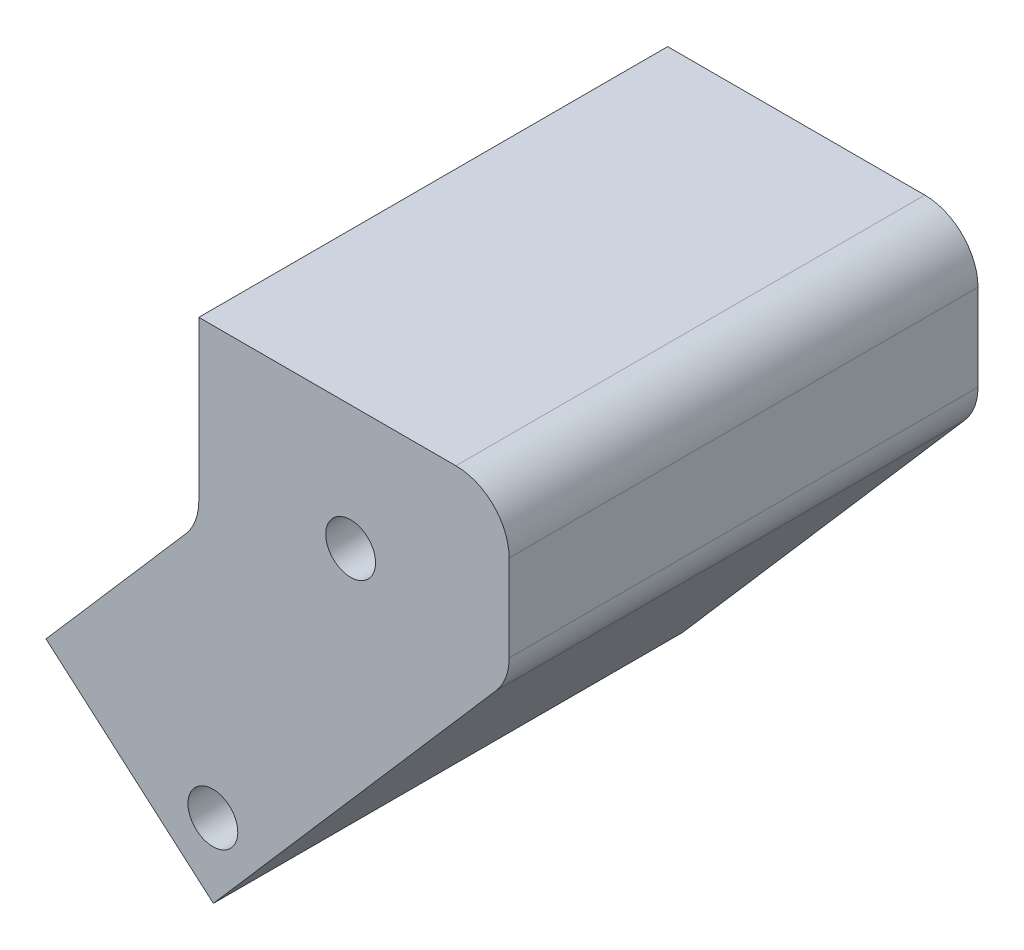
ISO-10303-21;
HEADER;
FILE_DESCRIPTION(('STEP AP214'),'2;1');
FILE_NAME('part.step','',(''),(''),'','','');
FILE_SCHEMA(('AUTOMOTIVE_DESIGN { 1 0 10303 214 1 1 1 1 }'));
ENDSEC;
DATA;
#1=APPLICATION_CONTEXT('core data for automotive mechanical design processes');
#2=APPLICATION_PROTOCOL_DEFINITION('international standard','automotive_design',2000,#1);
#3=PRODUCT_CONTEXT('',#1,'mechanical');
#4=PRODUCT('Part','Part','',(#3));
#5=PRODUCT_RELATED_PRODUCT_CATEGORY('part','',(#4));
#6=PRODUCT_DEFINITION_FORMATION('','',#4);
#7=PRODUCT_DEFINITION_CONTEXT('part definition',#1,'design');
#8=PRODUCT_DEFINITION('design','',#6,#7);
#9=PRODUCT_DEFINITION_SHAPE('','',#8);
#10=(LENGTH_UNIT() NAMED_UNIT(*) SI_UNIT(.MILLI.,.METRE.));
#11=(NAMED_UNIT(*) PLANE_ANGLE_UNIT() SI_UNIT($,.RADIAN.));
#12=(NAMED_UNIT(*) SI_UNIT($,.STERADIAN.) SOLID_ANGLE_UNIT());
#13=UNCERTAINTY_MEASURE_WITH_UNIT(LENGTH_MEASURE(1.E-05),#10,'distance_accuracy_value','');
#14=(GEOMETRIC_REPRESENTATION_CONTEXT(3) GLOBAL_UNCERTAINTY_ASSIGNED_CONTEXT((#13)) GLOBAL_UNIT_ASSIGNED_CONTEXT((#10,
#11,#12)) REPRESENTATION_CONTEXT('',''));
#15=CARTESIAN_POINT('',(0.,0.,0.));
#16=DIRECTION('',(0.,0.,1.));
#17=DIRECTION('',(1.,0.,0.));
#18=AXIS2_PLACEMENT_3D('',#15,#16,#17);
#19=CARTESIAN_POINT('',(-7.61612994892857E-11,2.4757973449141E-11,4.79986189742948));
#20=DIRECTION('',(-1.58417609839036E-11,5.13786431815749E-12,1.));
#21=DIRECTION('',(1.,0.,1.58417609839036E-11));
#22=AXIS2_PLACEMENT_3D('',#19,#20,#21);
#23=PLANE('',#22);
#24=CARTESIAN_POINT('',(-641.825795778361,-31.0085922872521,4.79986188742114));
#25=DIRECTION('',(0.,-5.13786431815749E-12,-1.));
#26=DIRECTION('',(0.,1.,-5.13786431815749E-12));
#27=AXIS2_PLACEMENT_3D('',#24,#25,#26);
#28=CIRCLE('',#27,5.35940000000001);
#29=CARTESIAN_POINT('',(-641.825795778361,-25.6491922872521,4.7998618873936));
#30=VERTEX_POINT('',#29);
#31=EDGE_CURVE('E262',#30,#30,#28,.T.);
#32=ORIENTED_EDGE('',*,*,#31,.F.);
#33=EDGE_LOOP('',(#32));
#34=FACE_BOUND('',#33,.T.);
#35=CARTESIAN_POINT('',(-661.55866411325,-74.2842172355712,4.79986188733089));
#36=DIRECTION('',(0.,-5.13786431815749E-12,-1.));
#37=DIRECTION('',(0.,1.,-5.13786431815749E-12));
#38=AXIS2_PLACEMENT_3D('',#35,#36,#37);
#39=CIRCLE('',#38,5.35940000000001);
#40=CARTESIAN_POINT('',(-661.55866411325,-68.9248172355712,4.79986188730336));
#41=VERTEX_POINT('',#40);
#42=EDGE_CURVE('E246',#41,#41,#39,.T.);
#43=ORIENTED_EDGE('',*,*,#42,.F.);
#44=EDGE_LOOP('',(#43));
#45=FACE_BOUND('',#44,.T.);
#46=DIRECTION('',(0.755030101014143,-0.655690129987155,1.53298533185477E-11));
#47=VECTOR('',#46,1.);
#48=CARTESIAN_POINT('',(-661.489319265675,-84.8572642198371,4.79986188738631));
#49=LINE('',#48,#47);
#50=CARTESIAN_POINT('',(-685.461524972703,-64.0391025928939,4.79986188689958));
#51=VERTEX_POINT('',#50);
#52=CARTESIAN_POINT('',(-661.489319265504,-84.8572642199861,4.79986188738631));
#53=VERTEX_POINT('',#52);
#54=EDGE_CURVE('E118',#51,#53,#49,.T.);
#55=ORIENTED_EDGE('',*,*,#54,.F.);
#56=DIRECTION('',(-0.655690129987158,-0.755030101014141,-6.50804410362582E-12));
#57=VECTOR('',#56,1.);
#58=CARTESIAN_POINT('',(-685.461524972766,-64.0391025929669,4.79986188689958));
#59=LINE('',#58,#57);
#60=CARTESIAN_POINT('',(-665.441670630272,-40.9861512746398,4.79986188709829));
#61=VERTEX_POINT('',#60);
#62=EDGE_CURVE('E125',#61,#51,#59,.T.);
#63=ORIENTED_EDGE('',*,*,#62,.F.);
#64=CARTESIAN_POINT('',(-671.195,-35.9897924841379,4.79986188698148));
#65=DIRECTION('',(-1.58417609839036E-11,5.13786431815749E-12,1.));
#66=DIRECTION('',(1.,0.,1.58417609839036E-11));
#67=AXIS2_PLACEMENT_3D('',#64,#65,#66);
#68=CIRCLE('',#67,7.61999999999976);
#69=CARTESIAN_POINT('',(-663.575,-35.9897924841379,4.7998618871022));
#70=VERTEX_POINT('',#69);
#71=EDGE_CURVE('E229',#70,#61,#68,.F.);
#72=ORIENTED_EDGE('',*,*,#71,.F.);
#73=DIRECTION('',(0.,-1.,5.13786431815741E-12));
#74=VECTOR('',#73,1.);
#75=CARTESIAN_POINT('',(-663.575,-35.9897924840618,4.7998618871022));
#76=LINE('',#75,#74);
#77=CARTESIAN_POINT('',(-663.575,-13.1998728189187,4.7998618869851));
#78=VERTEX_POINT('',#77);
#79=EDGE_CURVE('E225',#78,#70,#76,.T.);
#80=ORIENTED_EDGE('',*,*,#79,.F.);
#81=DIRECTION('',(-1.,0.,-1.58417609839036E-11));
#82=VECTOR('',#81,1.);
#83=CARTESIAN_POINT('',(-663.575000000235,-13.1998728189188,4.7998618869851));
#84=LINE('',#83,#82);
#85=CARTESIAN_POINT('',(-626.745,-13.1998728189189,4.79986188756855));
#86=VERTEX_POINT('',#85);
#87=EDGE_CURVE('E235',#86,#78,#84,.T.);
#88=ORIENTED_EDGE('',*,*,#87,.F.);
#89=CARTESIAN_POINT('',(-626.745,-20.8198728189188,4.7998618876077));
#90=DIRECTION('',(-1.58417609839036E-11,5.13786431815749E-12,1.));
#91=DIRECTION('',(1.,0.,1.58417609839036E-11));
#92=AXIS2_PLACEMENT_3D('',#89,#90,#91);
#93=CIRCLE('',#92,7.61999999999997);
#94=CARTESIAN_POINT('',(-619.125,-20.8198728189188,4.79986188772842));
#95=VERTEX_POINT('',#94);
#96=EDGE_CURVE('E216',#95,#86,#93,.T.);
#97=ORIENTED_EDGE('',*,*,#96,.F.);
#98=DIRECTION('',(0.,1.,-5.13786431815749E-12));
#99=VECTOR('',#98,1.);
#100=CARTESIAN_POINT('',(-619.125,-20.8198728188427,4.79986188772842));
#101=LINE('',#100,#99);
#102=CARTESIAN_POINT('',(-619.125,-33.2276829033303,4.79986188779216));
#103=VERTEX_POINT('',#102);
#104=EDGE_CURVE('E211',#103,#95,#101,.T.);
#105=ORIENTED_EDGE('',*,*,#104,.F.);
#106=CARTESIAN_POINT('',(-626.745,-33.2276829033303,4.79986188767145));
#107=DIRECTION('',(-1.58417609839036E-11,5.13786431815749E-12,1.));
#108=DIRECTION('',(1.,0.,1.58417609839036E-11));
#109=AXIS2_PLACEMENT_3D('',#106,#107,#108);
#110=CIRCLE('',#109,7.61999999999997);
#111=CARTESIAN_POINT('',(-620.991670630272,-38.2240416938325,4.79986188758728));
#112=VERTEX_POINT('',#111);
#113=EDGE_CURVE('E64',#112,#103,#110,.T.);
#114=ORIENTED_EDGE('',*,*,#113,.F.);
#115=DIRECTION('',(0.65569012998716,0.755030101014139,6.50804410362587E-12));
#116=VECTOR('',#115,1.);
#117=CARTESIAN_POINT('',(-620.991670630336,-38.2240416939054,4.79986188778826));
#118=LINE('',#117,#116);
#119=EDGE_CURVE('E12',#53,#112,#118,.T.);
#120=ORIENTED_EDGE('',*,*,#119,.F.);
#121=EDGE_LOOP('',(#55,#63,#72,#80,#88,#97,#105,#114,#120));
#122=FACE_BOUND('',#121,.T.);
#123=ADVANCED_FACE('F48',(#34,#45,#122),#23,.F.);
#124=CARTESIAN_POINT('',(-661.489319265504,-84.8572642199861,-10.033));
#125=DIRECTION('',(0.655690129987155,0.755030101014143,0.));
#126=DIRECTION('',(-0.755030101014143,0.655690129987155,0.));
#127=AXIS2_PLACEMENT_3D('',#124,#125,#126);
#128=PLANE('',#127);
#129=DIRECTION('',(0.,0.,1.));
#130=VECTOR('',#129,1.);
#131=CARTESIAN_POINT('',(-685.461524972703,-64.0391025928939,-10.033));
#132=LINE('',#131,#130);
#133=CARTESIAN_POINT('',(-685.461524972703,-64.0391025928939,71.9582));
#134=VERTEX_POINT('',#133);
#135=EDGE_CURVE('E57',#51,#134,#132,.T.);
#136=ORIENTED_EDGE('',*,*,#135,.F.);
#137=ORIENTED_EDGE('',*,*,#54,.T.);
#138=DIRECTION('',(0.,0.,1.));
#139=VECTOR('',#138,1.);
#140=CARTESIAN_POINT('',(-661.489319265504,-84.8572642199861,-10.033));
#141=LINE('',#140,#139);
#142=CARTESIAN_POINT('',(-661.489319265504,-84.8572642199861,71.9582));
#143=VERTEX_POINT('',#142);
#144=EDGE_CURVE('E71',#53,#143,#141,.T.);
#145=ORIENTED_EDGE('',*,*,#144,.T.);
#146=DIRECTION('',(-0.755030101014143,0.655690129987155,0.));
#147=VECTOR('',#146,1.);
#148=CARTESIAN_POINT('',(-661.489319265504,-84.8572642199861,71.9582));
#149=LINE('',#148,#147);
#150=EDGE_CURVE('E124',#143,#134,#149,.T.);
#151=ORIENTED_EDGE('',*,*,#150,.T.);
#152=EDGE_LOOP('',(#136,#137,#145,#151));
#153=FACE_BOUND('',#152,.T.);
#154=ADVANCED_FACE('F50',(#153),#128,.F.);
#155=CARTESIAN_POINT('',(-685.461524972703,-64.0391025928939,-10.033));
#156=DIRECTION('',(0.755030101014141,-0.655690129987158,0.));
#157=DIRECTION('',(0.655690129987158,0.755030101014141,0.));
#158=AXIS2_PLACEMENT_3D('',#155,#156,#157);
#159=PLANE('',#158);
#160=DIRECTION('',(0.,0.,1.));
#161=VECTOR('',#160,1.);
#162=CARTESIAN_POINT('',(-665.441670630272,-40.9861512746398,-10.033));
#163=LINE('',#162,#161);
#164=CARTESIAN_POINT('',(-665.441670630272,-40.9861512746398,71.9582));
#165=VERTEX_POINT('',#164);
#166=EDGE_CURVE('E157',#61,#165,#163,.T.);
#167=ORIENTED_EDGE('',*,*,#166,.F.);
#168=ORIENTED_EDGE('',*,*,#62,.T.);
#169=ORIENTED_EDGE('',*,*,#135,.T.);
#170=DIRECTION('',(0.655690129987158,0.755030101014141,0.));
#171=VECTOR('',#170,1.);
#172=CARTESIAN_POINT('',(-685.461524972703,-64.0391025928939,71.9582));
#173=LINE('',#172,#171);
#174=EDGE_CURVE('E166',#134,#165,#173,.T.);
#175=ORIENTED_EDGE('',*,*,#174,.T.);
#176=EDGE_LOOP('',(#167,#168,#169,#175));
#177=FACE_BOUND('',#176,.T.);
#178=ADVANCED_FACE('F165',(#177),#159,.F.);
#179=CARTESIAN_POINT('',(-671.195,-35.9897924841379,-10.033));
#180=DIRECTION('',(0.,0.,1.));
#181=DIRECTION('',(1.,0.,0.));
#182=AXIS2_PLACEMENT_3D('',#179,#180,#181);
#183=CYLINDRICAL_SURFACE('',#182,7.61999999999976);
#184=DIRECTION('',(0.,0.,1.));
#185=VECTOR('',#184,1.);
#186=CARTESIAN_POINT('',(-663.575,-35.9897924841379,-10.033));
#187=LINE('',#186,#185);
#188=CARTESIAN_POINT('',(-663.575,-35.9897924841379,71.9582));
#189=VERTEX_POINT('',#188);
#190=EDGE_CURVE('E154',#70,#189,#187,.T.);
#191=ORIENTED_EDGE('',*,*,#190,.F.);
#192=ORIENTED_EDGE('',*,*,#71,.T.);
#193=ORIENTED_EDGE('',*,*,#166,.T.);
#194=CARTESIAN_POINT('',(-671.195,-35.9897924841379,71.9582));
#195=DIRECTION('',(0.,0.,1.));
#196=DIRECTION('',(-1.,0.,0.));
#197=AXIS2_PLACEMENT_3D('',#194,#195,#196);
#198=CIRCLE('',#197,7.61999999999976);
#199=EDGE_CURVE('E172',#165,#189,#198,.T.);
#200=ORIENTED_EDGE('',*,*,#199,.T.);
#201=EDGE_LOOP('',(#191,#192,#193,#200));
#202=FACE_BOUND('',#201,.T.);
#203=ADVANCED_FACE('F228',(#202),#183,.F.);
#204=CARTESIAN_POINT('',(-663.575,-35.9897924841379,-10.033));
#205=DIRECTION('',(1.,0.,0.));
#206=DIRECTION('',(0.,1.,0.));
#207=AXIS2_PLACEMENT_3D('',#204,#205,#206);
#208=PLANE('',#207);
#209=DIRECTION('',(0.,0.,1.));
#210=VECTOR('',#209,1.);
#211=CARTESIAN_POINT('',(-663.575,-13.1998728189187,-10.033));
#212=LINE('',#211,#210);
#213=CARTESIAN_POINT('',(-663.575,-13.1998728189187,71.9582));
#214=VERTEX_POINT('',#213);
#215=EDGE_CURVE('E151',#78,#214,#212,.T.);
#216=ORIENTED_EDGE('',*,*,#215,.F.);
#217=ORIENTED_EDGE('',*,*,#79,.T.);
#218=ORIENTED_EDGE('',*,*,#190,.T.);
#219=DIRECTION('',(0.,1.,0.));
#220=VECTOR('',#219,1.);
#221=CARTESIAN_POINT('',(-663.575,-35.9897924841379,71.9582));
#222=LINE('',#221,#220);
#223=EDGE_CURVE('E182',#189,#214,#222,.T.);
#224=ORIENTED_EDGE('',*,*,#223,.T.);
#225=EDGE_LOOP('',(#216,#217,#218,#224));
#226=FACE_BOUND('',#225,.T.);
#227=ADVANCED_FACE('F222',(#226),#208,.F.);
#228=CARTESIAN_POINT('',(-663.575,-13.1998728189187,-10.033));
#229=DIRECTION('',(0.,-1.,0.));
#230=DIRECTION('',(1.,0.,0.));
#231=AXIS2_PLACEMENT_3D('',#228,#229,#230);
#232=PLANE('',#231);
#233=DIRECTION('',(0.,0.,1.));
#234=VECTOR('',#233,1.);
#235=CARTESIAN_POINT('',(-626.745,-13.1998728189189,-10.033));
#236=LINE('',#235,#234);
#237=CARTESIAN_POINT('',(-626.745,-13.1998728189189,71.9582));
#238=VERTEX_POINT('',#237);
#239=EDGE_CURVE('E148',#86,#238,#236,.T.);
#240=ORIENTED_EDGE('',*,*,#239,.F.);
#241=ORIENTED_EDGE('',*,*,#87,.T.);
#242=ORIENTED_EDGE('',*,*,#215,.T.);
#243=DIRECTION('',(1.,0.,0.));
#244=VECTOR('',#243,1.);
#245=CARTESIAN_POINT('',(-663.575,-13.1998728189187,71.9582));
#246=LINE('',#245,#244);
#247=EDGE_CURVE('E186',#214,#238,#246,.T.);
#248=ORIENTED_EDGE('',*,*,#247,.T.);
#249=EDGE_LOOP('',(#240,#241,#242,#248));
#250=FACE_BOUND('',#249,.T.);
#251=ADVANCED_FACE('F219',(#250),#232,.F.);
#252=CARTESIAN_POINT('',(-626.745,-20.8198728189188,-10.033));
#253=DIRECTION('',(0.,0.,1.));
#254=DIRECTION('',(1.,0.,0.));
#255=AXIS2_PLACEMENT_3D('',#252,#253,#254);
#256=CYLINDRICAL_SURFACE('',#255,7.61999999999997);
#257=DIRECTION('',(0.,0.,1.));
#258=VECTOR('',#257,1.);
#259=CARTESIAN_POINT('',(-619.125,-20.8198728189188,-10.033));
#260=LINE('',#259,#258);
#261=CARTESIAN_POINT('',(-619.125,-20.8198728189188,71.9582));
#262=VERTEX_POINT('',#261);
#263=EDGE_CURVE('E145',#95,#262,#260,.T.);
#264=ORIENTED_EDGE('',*,*,#263,.F.);
#265=ORIENTED_EDGE('',*,*,#96,.T.);
#266=ORIENTED_EDGE('',*,*,#239,.T.);
#267=CARTESIAN_POINT('',(-626.745,-20.8198728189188,71.9582));
#268=DIRECTION('',(0.,0.,-1.));
#269=DIRECTION('',(-1.,0.,0.));
#270=AXIS2_PLACEMENT_3D('',#267,#268,#269);
#271=CIRCLE('',#270,7.61999999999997);
#272=EDGE_CURVE('E190',#238,#262,#271,.T.);
#273=ORIENTED_EDGE('',*,*,#272,.T.);
#274=EDGE_LOOP('',(#264,#265,#266,#273));
#275=FACE_BOUND('',#274,.T.);
#276=ADVANCED_FACE('F214',(#275),#256,.T.);
#277=CARTESIAN_POINT('',(-619.125,-20.8198728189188,-10.033));
#278=DIRECTION('',(-1.,0.,0.));
#279=DIRECTION('',(0.,0.,1.));
#280=AXIS2_PLACEMENT_3D('',#277,#278,#279);
#281=PLANE('',#280);
#282=DIRECTION('',(0.,0.,1.));
#283=VECTOR('',#282,1.);
#284=CARTESIAN_POINT('',(-619.125,-33.2276829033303,-10.033));
#285=LINE('',#284,#283);
#286=CARTESIAN_POINT('',(-619.125,-33.2276829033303,71.9582));
#287=VERTEX_POINT('',#286);
#288=EDGE_CURVE('E137',#103,#287,#285,.T.);
#289=ORIENTED_EDGE('',*,*,#288,.F.);
#290=ORIENTED_EDGE('',*,*,#104,.T.);
#291=ORIENTED_EDGE('',*,*,#263,.T.);
#292=DIRECTION('',(0.,-1.,0.));
#293=VECTOR('',#292,1.);
#294=CARTESIAN_POINT('',(-619.125,-20.8198728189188,71.9582));
#295=LINE('',#294,#293);
#296=EDGE_CURVE('E194',#262,#287,#295,.T.);
#297=ORIENTED_EDGE('',*,*,#296,.T.);
#298=EDGE_LOOP('',(#289,#290,#291,#297));
#299=FACE_BOUND('',#298,.T.);
#300=ADVANCED_FACE('F208',(#299),#281,.F.);
#301=CARTESIAN_POINT('',(-626.745,-33.2276829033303,-10.033));
#302=DIRECTION('',(0.,0.,1.));
#303=DIRECTION('',(1.,0.,0.));
#304=AXIS2_PLACEMENT_3D('',#301,#302,#303);
#305=CYLINDRICAL_SURFACE('',#304,7.61999999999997);
#306=DIRECTION('',(0.,0.,1.));
#307=VECTOR('',#306,1.);
#308=CARTESIAN_POINT('',(-620.991670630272,-38.2240416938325,-10.033));
#309=LINE('',#308,#307);
#310=CARTESIAN_POINT('',(-620.991670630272,-38.2240416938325,71.9582));
#311=VERTEX_POINT('',#310);
#312=EDGE_CURVE('E132',#112,#311,#309,.T.);
#313=ORIENTED_EDGE('',*,*,#312,.F.);
#314=ORIENTED_EDGE('',*,*,#113,.T.);
#315=ORIENTED_EDGE('',*,*,#288,.T.);
#316=CARTESIAN_POINT('',(-626.745,-33.2276829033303,71.9582));
#317=DIRECTION('',(0.,0.,-1.));
#318=DIRECTION('',(-1.,0.,0.));
#319=AXIS2_PLACEMENT_3D('',#316,#317,#318);
#320=CIRCLE('',#319,7.61999999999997);
#321=EDGE_CURVE('E139',#287,#311,#320,.T.);
#322=ORIENTED_EDGE('',*,*,#321,.T.);
#323=EDGE_LOOP('',(#313,#314,#315,#322));
#324=FACE_BOUND('',#323,.T.);
#325=ADVANCED_FACE('F202',(#324),#305,.T.);
#326=CARTESIAN_POINT('',(-620.991670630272,-38.2240416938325,-10.033));
#327=DIRECTION('',(-0.755030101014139,0.65569012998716,0.));
#328=DIRECTION('',(-0.65569012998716,-0.755030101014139,0.));
#329=AXIS2_PLACEMENT_3D('',#326,#327,#328);
#330=PLANE('',#329);
#331=ORIENTED_EDGE('',*,*,#144,.F.);
#332=ORIENTED_EDGE('',*,*,#119,.T.);
#333=ORIENTED_EDGE('',*,*,#312,.T.);
#334=DIRECTION('',(-0.65569012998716,-0.755030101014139,0.));
#335=VECTOR('',#334,1.);
#336=CARTESIAN_POINT('',(-620.991670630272,-38.2240416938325,71.9582));
#337=LINE('',#336,#335);
#338=EDGE_CURVE('E129',#311,#143,#337,.T.);
#339=ORIENTED_EDGE('',*,*,#338,.T.);
#340=EDGE_LOOP('',(#331,#332,#333,#339));
#341=FACE_BOUND('',#340,.T.);
#342=ADVANCED_FACE('F127',(#341),#330,.F.);
#343=CARTESIAN_POINT('',(-671.195,-35.9897924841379,71.9582));
#344=DIRECTION('',(0.,0.,-1.));
#345=DIRECTION('',(-1.,0.,0.));
#346=AXIS2_PLACEMENT_3D('',#343,#344,#345);
#347=PLANE('',#346);
#348=CARTESIAN_POINT('',(-641.825795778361,-31.0085922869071,71.9582000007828));
#349=DIRECTION('',(0.,-5.13786431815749E-12,-1.));
#350=DIRECTION('',(0.,1.,-5.13786431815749E-12));
#351=AXIS2_PLACEMENT_3D('',#348,#349,#350);
#352=CIRCLE('',#351,3.56869999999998);
#353=CARTESIAN_POINT('',(-641.825795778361,-27.4398922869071,71.9582000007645));
#354=VERTEX_POINT('',#353);
#355=EDGE_CURVE('E274',#354,#354,#352,.T.);
#356=ORIENTED_EDGE('',*,*,#355,.T.);
#357=EDGE_LOOP('',(#356));
#358=FACE_BOUND('',#357,.T.);
#359=CARTESIAN_POINT('',(-661.558664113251,-74.2842172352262,71.9582000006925));
#360=DIRECTION('',(0.,-5.13786431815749E-12,-1.));
#361=DIRECTION('',(0.,1.,-5.13786431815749E-12));
#362=AXIS2_PLACEMENT_3D('',#359,#360,#361);
#363=CIRCLE('',#362,3.56869999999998);
#364=CARTESIAN_POINT('',(-661.558664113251,-70.7155172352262,71.9582000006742));
#365=VERTEX_POINT('',#364);
#366=EDGE_CURVE('E258',#365,#365,#363,.T.);
#367=ORIENTED_EDGE('',*,*,#366,.T.);
#368=EDGE_LOOP('',(#367));
#369=FACE_BOUND('',#368,.T.);
#370=ORIENTED_EDGE('',*,*,#150,.F.);
#371=ORIENTED_EDGE('',*,*,#338,.F.);
#372=ORIENTED_EDGE('',*,*,#321,.F.);
#373=ORIENTED_EDGE('',*,*,#296,.F.);
#374=ORIENTED_EDGE('',*,*,#272,.F.);
#375=ORIENTED_EDGE('',*,*,#247,.F.);
#376=ORIENTED_EDGE('',*,*,#223,.F.);
#377=ORIENTED_EDGE('',*,*,#199,.F.);
#378=ORIENTED_EDGE('',*,*,#174,.F.);
#379=EDGE_LOOP('',(#370,#371,#372,#373,#374,#375,#376,#377,#378));
#380=FACE_BOUND('',#379,.T.);
#381=ADVANCED_FACE('F169',(#358,#369,#380),#347,.F.);
#382=CARTESIAN_POINT('',(-661.55866411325,-74.2842172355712,4.79986188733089));
#383=DIRECTION('',(0.,-5.13786431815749E-12,-1.));
#384=DIRECTION('',(0.,1.,-5.13786431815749E-12));
#385=AXIS2_PLACEMENT_3D('',#382,#383,#384);
#386=CYLINDRICAL_SURFACE('',#385,5.35940000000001);
#387=CARTESIAN_POINT('',(-661.55866411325,-74.284217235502,18.2618618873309));
#388=DIRECTION('',(0.,-5.13786431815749E-12,-1.));
#389=DIRECTION('',(0.,1.,-5.13786431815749E-12));
#390=AXIS2_PLACEMENT_3D('',#387,#388,#389);
#391=CIRCLE('',#390,5.35940000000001);
#392=CARTESIAN_POINT('',(-661.55866411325,-68.924817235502,18.2618618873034));
#393=VERTEX_POINT('',#392);
#394=EDGE_CURVE('E250',#393,#393,#391,.T.);
#395=ORIENTED_EDGE('',*,*,#394,.F.);
#396=EDGE_LOOP('',(#395));
#397=FACE_BOUND('',#396,.T.);
#398=ORIENTED_EDGE('',*,*,#42,.T.);
#399=EDGE_LOOP('',(#398));
#400=FACE_BOUND('',#399,.T.);
#401=ADVANCED_FACE('F306',(#397,#400),#386,.F.);
#402=CARTESIAN_POINT('',(-657.98996411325,-74.2842172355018,18.2618618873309));
#403=DIRECTION('',(0.,5.13786431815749E-12,1.));
#404=DIRECTION('',(0.,-1.,5.13786431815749E-12));
#405=AXIS2_PLACEMENT_3D('',#402,#403,#404);
#406=PLANE('',#405);
#407=CARTESIAN_POINT('',(-661.55866411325,-74.284217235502,18.2618618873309));
#408=DIRECTION('',(0.,-5.13786431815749E-12,-1.));
#409=DIRECTION('',(0.,1.,-5.13786431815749E-12));
#410=AXIS2_PLACEMENT_3D('',#407,#408,#409);
#411=CIRCLE('',#410,3.56869999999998);
#412=CARTESIAN_POINT('',(-661.55866411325,-70.715517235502,18.2618618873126));
#413=VERTEX_POINT('',#412);
#414=EDGE_CURVE('E254',#413,#413,#411,.T.);
#415=ORIENTED_EDGE('',*,*,#414,.F.);
#416=EDGE_LOOP('',(#415));
#417=FACE_BOUND('',#416,.T.);
#418=ORIENTED_EDGE('',*,*,#394,.T.);
#419=EDGE_LOOP('',(#418));
#420=FACE_BOUND('',#419,.T.);
#421=ADVANCED_FACE('F308',(#417,#420),#406,.F.);
#422=CARTESIAN_POINT('',(-661.55866411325,-74.2842172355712,4.79986188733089));
#423=DIRECTION('',(0.,-5.13786431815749E-12,-1.));
#424=DIRECTION('',(0.,1.,-5.13786431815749E-12));
#425=AXIS2_PLACEMENT_3D('',#422,#423,#424);
#426=CYLINDRICAL_SURFACE('',#425,3.56869999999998);
#427=ORIENTED_EDGE('',*,*,#366,.F.);
#428=EDGE_LOOP('',(#427));
#429=FACE_BOUND('',#428,.T.);
#430=ORIENTED_EDGE('',*,*,#414,.T.);
#431=EDGE_LOOP('',(#430));
#432=FACE_BOUND('',#431,.T.);
#433=ADVANCED_FACE('F297',(#429,#432),#426,.F.);
#434=CARTESIAN_POINT('',(-641.825795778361,-31.0085922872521,4.79986188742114));
#435=DIRECTION('',(0.,-5.13786431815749E-12,-1.));
#436=DIRECTION('',(0.,1.,-5.13786431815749E-12));
#437=AXIS2_PLACEMENT_3D('',#434,#435,#436);
#438=CYLINDRICAL_SURFACE('',#437,5.35940000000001);
#439=CARTESIAN_POINT('',(-641.825795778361,-31.0085922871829,18.2618618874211));
#440=DIRECTION('',(0.,-5.13786431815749E-12,-1.));
#441=DIRECTION('',(0.,1.,-5.13786431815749E-12));
#442=AXIS2_PLACEMENT_3D('',#439,#440,#441);
#443=CIRCLE('',#442,5.35940000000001);
#444=CARTESIAN_POINT('',(-641.825795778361,-25.6491922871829,18.2618618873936));
#445=VERTEX_POINT('',#444);
#446=EDGE_CURVE('E266',#445,#445,#443,.T.);
#447=ORIENTED_EDGE('',*,*,#446,.F.);
#448=EDGE_LOOP('',(#447));
#449=FACE_BOUND('',#448,.T.);
#450=ORIENTED_EDGE('',*,*,#31,.T.);
#451=EDGE_LOOP('',(#450));
#452=FACE_BOUND('',#451,.T.);
#453=ADVANCED_FACE('F291',(#449,#452),#438,.F.);
#454=CARTESIAN_POINT('',(-638.257095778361,-31.0085922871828,18.2618618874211));
#455=DIRECTION('',(0.,5.13786431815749E-12,1.));
#456=DIRECTION('',(0.,-1.,5.13786431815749E-12));
#457=AXIS2_PLACEMENT_3D('',#454,#455,#456);
#458=PLANE('',#457);
#459=CARTESIAN_POINT('',(-641.825795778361,-31.0085922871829,18.2618618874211));
#460=DIRECTION('',(0.,-5.13786431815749E-12,-1.));
#461=DIRECTION('',(0.,1.,-5.13786431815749E-12));
#462=AXIS2_PLACEMENT_3D('',#459,#460,#461);
#463=CIRCLE('',#462,3.56869999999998);
#464=CARTESIAN_POINT('',(-641.825795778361,-27.439892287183,18.2618618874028));
#465=VERTEX_POINT('',#464);
#466=EDGE_CURVE('E270',#465,#465,#463,.T.);
#467=ORIENTED_EDGE('',*,*,#466,.F.);
#468=EDGE_LOOP('',(#467));
#469=FACE_BOUND('',#468,.T.);
#470=ORIENTED_EDGE('',*,*,#446,.T.);
#471=EDGE_LOOP('',(#470));
#472=FACE_BOUND('',#471,.T.);
#473=ADVANCED_FACE('F285',(#469,#472),#458,.F.);
#474=CARTESIAN_POINT('',(-641.825795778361,-31.0085922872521,4.79986188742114));
#475=DIRECTION('',(0.,-5.13786431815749E-12,-1.));
#476=DIRECTION('',(0.,1.,-5.13786431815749E-12));
#477=AXIS2_PLACEMENT_3D('',#474,#475,#476);
#478=CYLINDRICAL_SURFACE('',#477,3.56869999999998);
#479=ORIENTED_EDGE('',*,*,#355,.F.);
#480=EDGE_LOOP('',(#479));
#481=FACE_BOUND('',#480,.T.);
#482=ORIENTED_EDGE('',*,*,#466,.T.);
#483=EDGE_LOOP('',(#482));
#484=FACE_BOUND('',#483,.T.);
#485=ADVANCED_FACE('F282',(#481,#484),#478,.F.);
#486=CLOSED_SHELL('',(#123,#154,#178,#203,#227,#251,#276,#300,#325,#342,#381,#401,#421,#433,
#453,#473,#485));
#487=MANIFOLD_SOLID_BREP('B2',#486);
#488=ADVANCED_BREP_SHAPE_REPRESENTATION('',(#18,#487),#14);
#489=SHAPE_DEFINITION_REPRESENTATION(#9,#488);
ENDSEC;
END-ISO-10303-21;
